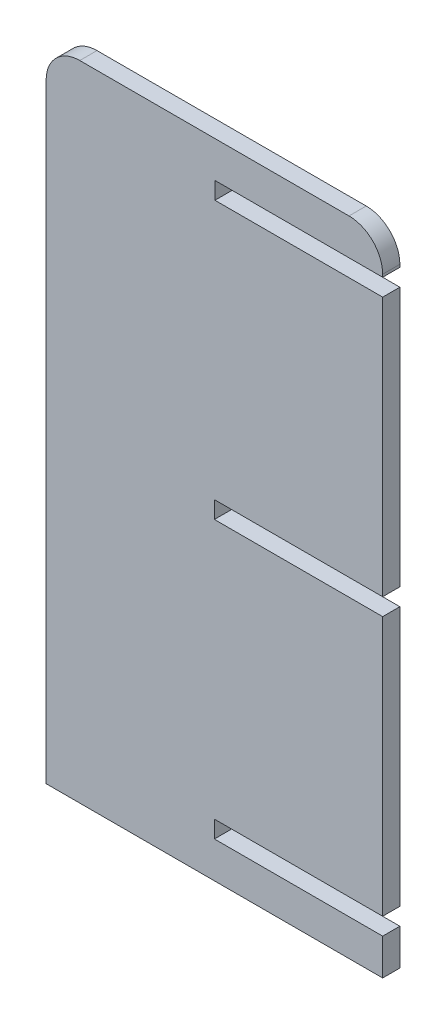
ISO-10303-21;
HEADER;
FILE_DESCRIPTION(('STEP AP214'),'2;1');
FILE_NAME('part.step','',(''),(''),'','','');
FILE_SCHEMA(('AUTOMOTIVE_DESIGN { 1 0 10303 214 1 1 1 1 }'));
ENDSEC;
DATA;
#1=APPLICATION_CONTEXT('core data for automotive mechanical design processes');
#2=APPLICATION_PROTOCOL_DEFINITION('international standard','automotive_design',2000,#1);
#3=PRODUCT_CONTEXT('',#1,'mechanical');
#4=PRODUCT('Part','Part','',(#3));
#5=PRODUCT_RELATED_PRODUCT_CATEGORY('part','',(#4));
#6=PRODUCT_DEFINITION_FORMATION('','',#4);
#7=PRODUCT_DEFINITION_CONTEXT('part definition',#1,'design');
#8=PRODUCT_DEFINITION('design','',#6,#7);
#9=PRODUCT_DEFINITION_SHAPE('','',#8);
#10=(LENGTH_UNIT() NAMED_UNIT(*) SI_UNIT(.MILLI.,.METRE.));
#11=(NAMED_UNIT(*) PLANE_ANGLE_UNIT() SI_UNIT($,.RADIAN.));
#12=(NAMED_UNIT(*) SI_UNIT($,.STERADIAN.) SOLID_ANGLE_UNIT());
#13=UNCERTAINTY_MEASURE_WITH_UNIT(LENGTH_MEASURE(1.E-05),#10,'distance_accuracy_value','');
#14=(GEOMETRIC_REPRESENTATION_CONTEXT(3) GLOBAL_UNCERTAINTY_ASSIGNED_CONTEXT((#13)) GLOBAL_UNIT_ASSIGNED_CONTEXT((#10,
#11,#12)) REPRESENTATION_CONTEXT('',''));
#15=CARTESIAN_POINT('',(0.,0.,0.));
#16=DIRECTION('',(0.,0.,1.));
#17=DIRECTION('',(1.,0.,0.));
#18=AXIS2_PLACEMENT_3D('',#15,#16,#17);
#19=CARTESIAN_POINT('',(-222.670481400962,185.207556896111,23.));
#20=DIRECTION('',(1.,0.,0.));
#21=DIRECTION('',(0.,1.,0.));
#22=AXIS2_PLACEMENT_3D('',#19,#20,#21);
#23=PLANE('',#22);
#24=DIRECTION('',(0.,-1.,0.));
#25=VECTOR('',#24,1.);
#26=CARTESIAN_POINT('',(-222.670481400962,185.207556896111,0.));
#27=LINE('',#26,#25);
#28=CARTESIAN_POINT('',(-222.670481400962,185.207556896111,0.));
#29=VERTEX_POINT('',#28);
#30=CARTESIAN_POINT('',(-222.670481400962,-629.792443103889,0.));
#31=VERTEX_POINT('',#30);
#32=EDGE_CURVE('E188',#29,#31,#27,.T.);
#33=ORIENTED_EDGE('',*,*,#32,.T.);
#34=DIRECTION('',(0.,0.,-1.));
#35=VECTOR('',#34,1.);
#36=CARTESIAN_POINT('',(-222.670481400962,-629.792443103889,23.));
#37=LINE('',#36,#35);
#38=CARTESIAN_POINT('',(-222.670481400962,-629.792443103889,23.));
#39=VERTEX_POINT('',#38);
#40=EDGE_CURVE('E11',#39,#31,#37,.T.);
#41=ORIENTED_EDGE('',*,*,#40,.F.);
#42=DIRECTION('',(0.,-1.,0.));
#43=VECTOR('',#42,1.);
#44=CARTESIAN_POINT('',(-222.670481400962,185.207556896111,23.));
#45=LINE('',#44,#43);
#46=CARTESIAN_POINT('',(-222.670481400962,185.207556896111,23.));
#47=VERTEX_POINT('',#46);
#48=EDGE_CURVE('E222',#47,#39,#45,.T.);
#49=ORIENTED_EDGE('',*,*,#48,.F.);
#50=DIRECTION('',(0.,0.,-1.));
#51=VECTOR('',#50,1.);
#52=CARTESIAN_POINT('',(-222.670481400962,185.207556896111,23.));
#53=LINE('',#52,#51);
#54=EDGE_CURVE('E184',#47,#29,#53,.T.);
#55=ORIENTED_EDGE('',*,*,#54,.T.);
#56=EDGE_LOOP('',(#33,#41,#49,#55));
#57=FACE_BOUND('',#56,.T.);
#58=ADVANCED_FACE('F32',(#57),#23,.F.);
#59=CARTESIAN_POINT('',(-222.670481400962,-629.792443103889,23.));
#60=DIRECTION('',(0.,1.,0.));
#61=DIRECTION('',(0.,0.,1.));
#62=AXIS2_PLACEMENT_3D('',#59,#60,#61);
#63=PLANE('',#62);
#64=DIRECTION('',(1.,0.,0.));
#65=VECTOR('',#64,1.);
#66=CARTESIAN_POINT('',(-222.670481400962,-629.792443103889,0.));
#67=LINE('',#66,#65);
#68=CARTESIAN_POINT('',(227.329518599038,-629.792443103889,0.));
#69=VERTEX_POINT('',#68);
#70=EDGE_CURVE('E191',#31,#69,#67,.T.);
#71=ORIENTED_EDGE('',*,*,#70,.T.);
#72=DIRECTION('',(0.,0.,-1.));
#73=VECTOR('',#72,1.);
#74=CARTESIAN_POINT('',(227.329518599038,-629.792443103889,23.));
#75=LINE('',#74,#73);
#76=CARTESIAN_POINT('',(227.329518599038,-629.792443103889,23.));
#77=VERTEX_POINT('',#76);
#78=EDGE_CURVE('E40',#77,#69,#75,.T.);
#79=ORIENTED_EDGE('',*,*,#78,.F.);
#80=DIRECTION('',(1.,0.,0.));
#81=VECTOR('',#80,1.);
#82=CARTESIAN_POINT('',(-222.670481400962,-629.792443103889,23.));
#83=LINE('',#82,#81);
#84=EDGE_CURVE('E121',#39,#77,#83,.T.);
#85=ORIENTED_EDGE('',*,*,#84,.F.);
#86=ORIENTED_EDGE('',*,*,#40,.T.);
#87=EDGE_LOOP('',(#71,#79,#85,#86));
#88=FACE_BOUND('',#87,.T.);
#89=ADVANCED_FACE('F330',(#88),#63,.F.);
#90=CARTESIAN_POINT('',(227.329518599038,-629.792443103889,23.));
#91=DIRECTION('',(-1.,0.,0.));
#92=DIRECTION('',(0.,0.,1.));
#93=AXIS2_PLACEMENT_3D('',#90,#91,#92);
#94=PLANE('',#93);
#95=DIRECTION('',(0.,1.,0.));
#96=VECTOR('',#95,1.);
#97=CARTESIAN_POINT('',(227.329518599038,-629.792443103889,0.));
#98=LINE('',#97,#96);
#99=CARTESIAN_POINT('',(227.329518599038,-581.292443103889,0.));
#100=VERTEX_POINT('',#99);
#101=EDGE_CURVE('E193',#69,#100,#98,.T.);
#102=ORIENTED_EDGE('',*,*,#101,.T.);
#103=DIRECTION('',(0.,0.,-1.));
#104=VECTOR('',#103,1.);
#105=CARTESIAN_POINT('',(227.329518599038,-581.292443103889,23.));
#106=LINE('',#105,#104);
#107=CARTESIAN_POINT('',(227.329518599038,-581.292443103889,23.));
#108=VERTEX_POINT('',#107);
#109=EDGE_CURVE('E259',#108,#100,#106,.T.);
#110=ORIENTED_EDGE('',*,*,#109,.F.);
#111=DIRECTION('',(0.,1.,0.));
#112=VECTOR('',#111,1.);
#113=CARTESIAN_POINT('',(227.329518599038,-629.792443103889,23.));
#114=LINE('',#113,#112);
#115=EDGE_CURVE('E267',#77,#108,#114,.T.);
#116=ORIENTED_EDGE('',*,*,#115,.F.);
#117=ORIENTED_EDGE('',*,*,#78,.T.);
#118=EDGE_LOOP('',(#102,#110,#116,#117));
#119=FACE_BOUND('',#118,.T.);
#120=ADVANCED_FACE('F265',(#119),#94,.F.);
#121=CARTESIAN_POINT('',(227.329518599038,-581.292443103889,23.));
#122=DIRECTION('',(0.,-1.,0.));
#123=DIRECTION('',(0.,0.,-1.));
#124=AXIS2_PLACEMENT_3D('',#121,#122,#123);
#125=PLANE('',#124);
#126=DIRECTION('',(-1.,0.,0.));
#127=VECTOR('',#126,1.);
#128=CARTESIAN_POINT('',(227.329518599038,-581.292443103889,0.));
#129=LINE('',#128,#127);
#130=CARTESIAN_POINT('',(2.32951859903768,-581.292443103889,0.));
#131=VERTEX_POINT('',#130);
#132=EDGE_CURVE('E195',#100,#131,#129,.T.);
#133=ORIENTED_EDGE('',*,*,#132,.T.);
#134=DIRECTION('',(0.,0.,-1.));
#135=VECTOR('',#134,1.);
#136=CARTESIAN_POINT('',(2.32951859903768,-581.292443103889,23.));
#137=LINE('',#136,#135);
#138=CARTESIAN_POINT('',(2.32951859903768,-581.292443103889,23.));
#139=VERTEX_POINT('',#138);
#140=EDGE_CURVE('E256',#139,#131,#137,.T.);
#141=ORIENTED_EDGE('',*,*,#140,.F.);
#142=DIRECTION('',(-1.,0.,0.));
#143=VECTOR('',#142,1.);
#144=CARTESIAN_POINT('',(227.329518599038,-581.292443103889,23.));
#145=LINE('',#144,#143);
#146=EDGE_CURVE('E285',#108,#139,#145,.T.);
#147=ORIENTED_EDGE('',*,*,#146,.F.);
#148=ORIENTED_EDGE('',*,*,#109,.T.);
#149=EDGE_LOOP('',(#133,#141,#147,#148));
#150=FACE_BOUND('',#149,.T.);
#151=ADVANCED_FACE('F276',(#150),#125,.F.);
#152=CARTESIAN_POINT('',(2.32951859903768,-581.292443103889,23.));
#153=DIRECTION('',(-1.,0.,0.));
#154=DIRECTION('',(0.,0.,1.));
#155=AXIS2_PLACEMENT_3D('',#152,#153,#154);
#156=PLANE('',#155);
#157=DIRECTION('',(0.,1.,0.));
#158=VECTOR('',#157,1.);
#159=CARTESIAN_POINT('',(2.32951859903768,-581.292443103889,0.));
#160=LINE('',#159,#158);
#161=CARTESIAN_POINT('',(2.32951859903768,-558.292443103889,0.));
#162=VERTEX_POINT('',#161);
#163=EDGE_CURVE('E197',#131,#162,#160,.T.);
#164=ORIENTED_EDGE('',*,*,#163,.T.);
#165=DIRECTION('',(0.,0.,-1.));
#166=VECTOR('',#165,1.);
#167=CARTESIAN_POINT('',(2.32951859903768,-558.292443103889,23.));
#168=LINE('',#167,#166);
#169=CARTESIAN_POINT('',(2.32951859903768,-558.292443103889,23.));
#170=VERTEX_POINT('',#169);
#171=EDGE_CURVE('E253',#170,#162,#168,.T.);
#172=ORIENTED_EDGE('',*,*,#171,.F.);
#173=DIRECTION('',(0.,1.,0.));
#174=VECTOR('',#173,1.);
#175=CARTESIAN_POINT('',(2.32951859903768,-581.292443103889,23.));
#176=LINE('',#175,#174);
#177=EDGE_CURVE('E282',#139,#170,#176,.T.);
#178=ORIENTED_EDGE('',*,*,#177,.F.);
#179=ORIENTED_EDGE('',*,*,#140,.T.);
#180=EDGE_LOOP('',(#164,#172,#178,#179));
#181=FACE_BOUND('',#180,.T.);
#182=ADVANCED_FACE('F280',(#181),#156,.F.);
#183=CARTESIAN_POINT('',(2.32951859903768,-558.292443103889,23.));
#184=DIRECTION('',(0.,1.,0.));
#185=DIRECTION('',(0.,0.,1.));
#186=AXIS2_PLACEMENT_3D('',#183,#184,#185);
#187=PLANE('',#186);
#188=DIRECTION('',(1.,0.,0.));
#189=VECTOR('',#188,1.);
#190=CARTESIAN_POINT('',(2.32951859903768,-558.292443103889,0.));
#191=LINE('',#190,#189);
#192=CARTESIAN_POINT('',(227.329518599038,-558.292443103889,0.));
#193=VERTEX_POINT('',#192);
#194=EDGE_CURVE('E199',#162,#193,#191,.T.);
#195=ORIENTED_EDGE('',*,*,#194,.T.);
#196=DIRECTION('',(0.,0.,-1.));
#197=VECTOR('',#196,1.);
#198=CARTESIAN_POINT('',(227.329518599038,-558.292443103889,23.));
#199=LINE('',#198,#197);
#200=CARTESIAN_POINT('',(227.329518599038,-558.292443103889,23.));
#201=VERTEX_POINT('',#200);
#202=EDGE_CURVE('E250',#201,#193,#199,.T.);
#203=ORIENTED_EDGE('',*,*,#202,.F.);
#204=DIRECTION('',(1.,0.,0.));
#205=VECTOR('',#204,1.);
#206=CARTESIAN_POINT('',(2.32951859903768,-558.292443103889,23.));
#207=LINE('',#206,#205);
#208=EDGE_CURVE('E284',#170,#201,#207,.T.);
#209=ORIENTED_EDGE('',*,*,#208,.F.);
#210=ORIENTED_EDGE('',*,*,#171,.T.);
#211=EDGE_LOOP('',(#195,#203,#209,#210));
#212=FACE_BOUND('',#211,.T.);
#213=ADVANCED_FACE('F343',(#212),#187,.F.);
#214=CARTESIAN_POINT('',(227.329518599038,-558.292443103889,23.));
#215=DIRECTION('',(-1.,0.,0.));
#216=DIRECTION('',(0.,0.,1.));
#217=AXIS2_PLACEMENT_3D('',#214,#215,#216);
#218=PLANE('',#217);
#219=DIRECTION('',(0.,1.,0.));
#220=VECTOR('',#219,1.);
#221=CARTESIAN_POINT('',(227.329518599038,-558.292443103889,0.));
#222=LINE('',#221,#220);
#223=CARTESIAN_POINT('',(227.329518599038,-211.292443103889,0.));
#224=VERTEX_POINT('',#223);
#225=EDGE_CURVE('E201',#193,#224,#222,.T.);
#226=ORIENTED_EDGE('',*,*,#225,.T.);
#227=DIRECTION('',(0.,0.,-1.));
#228=VECTOR('',#227,1.);
#229=CARTESIAN_POINT('',(227.329518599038,-211.292443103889,23.));
#230=LINE('',#229,#228);
#231=CARTESIAN_POINT('',(227.329518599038,-211.292443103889,23.));
#232=VERTEX_POINT('',#231);
#233=EDGE_CURVE('E247',#232,#224,#230,.T.);
#234=ORIENTED_EDGE('',*,*,#233,.F.);
#235=DIRECTION('',(0.,1.,0.));
#236=VECTOR('',#235,1.);
#237=CARTESIAN_POINT('',(227.329518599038,-558.292443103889,23.));
#238=LINE('',#237,#236);
#239=EDGE_CURVE('E287',#201,#232,#238,.T.);
#240=ORIENTED_EDGE('',*,*,#239,.F.);
#241=ORIENTED_EDGE('',*,*,#202,.T.);
#242=EDGE_LOOP('',(#226,#234,#240,#241));
#243=FACE_BOUND('',#242,.T.);
#244=ADVANCED_FACE('F346',(#243),#218,.F.);
#245=CARTESIAN_POINT('',(227.329518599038,-211.292443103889,23.));
#246=DIRECTION('',(0.,-1.,0.));
#247=DIRECTION('',(0.,0.,-1.));
#248=AXIS2_PLACEMENT_3D('',#245,#246,#247);
#249=PLANE('',#248);
#250=DIRECTION('',(-1.,0.,0.));
#251=VECTOR('',#250,1.);
#252=CARTESIAN_POINT('',(227.329518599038,-211.292443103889,0.));
#253=LINE('',#252,#251);
#254=CARTESIAN_POINT('',(2.32951859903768,-211.292443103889,0.));
#255=VERTEX_POINT('',#254);
#256=EDGE_CURVE('E203',#224,#255,#253,.T.);
#257=ORIENTED_EDGE('',*,*,#256,.T.);
#258=DIRECTION('',(0.,0.,-1.));
#259=VECTOR('',#258,1.);
#260=CARTESIAN_POINT('',(2.32951859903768,-211.292443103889,23.));
#261=LINE('',#260,#259);
#262=CARTESIAN_POINT('',(2.32951859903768,-211.292443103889,23.));
#263=VERTEX_POINT('',#262);
#264=EDGE_CURVE('E244',#263,#255,#261,.T.);
#265=ORIENTED_EDGE('',*,*,#264,.F.);
#266=DIRECTION('',(-1.,0.,0.));
#267=VECTOR('',#266,1.);
#268=CARTESIAN_POINT('',(227.329518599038,-211.292443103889,23.));
#269=LINE('',#268,#267);
#270=EDGE_CURVE('E293',#232,#263,#269,.T.);
#271=ORIENTED_EDGE('',*,*,#270,.F.);
#272=ORIENTED_EDGE('',*,*,#233,.T.);
#273=EDGE_LOOP('',(#257,#265,#271,#272));
#274=FACE_BOUND('',#273,.T.);
#275=ADVANCED_FACE('F350',(#274),#249,.F.);
#276=CARTESIAN_POINT('',(2.32951859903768,-211.292443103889,23.));
#277=DIRECTION('',(-1.,0.,0.));
#278=DIRECTION('',(0.,0.,1.));
#279=AXIS2_PLACEMENT_3D('',#276,#277,#278);
#280=PLANE('',#279);
#281=DIRECTION('',(0.,1.,0.));
#282=VECTOR('',#281,1.);
#283=CARTESIAN_POINT('',(2.32951859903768,-211.292443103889,0.));
#284=LINE('',#283,#282);
#285=CARTESIAN_POINT('',(2.32951859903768,-188.292443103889,0.));
#286=VERTEX_POINT('',#285);
#287=EDGE_CURVE('E205',#255,#286,#284,.T.);
#288=ORIENTED_EDGE('',*,*,#287,.T.);
#289=DIRECTION('',(0.,0.,-1.));
#290=VECTOR('',#289,1.);
#291=CARTESIAN_POINT('',(2.32951859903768,-188.292443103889,23.));
#292=LINE('',#291,#290);
#293=CARTESIAN_POINT('',(2.32951859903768,-188.292443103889,23.));
#294=VERTEX_POINT('',#293);
#295=EDGE_CURVE('E241',#294,#286,#292,.T.);
#296=ORIENTED_EDGE('',*,*,#295,.F.);
#297=DIRECTION('',(0.,1.,0.));
#298=VECTOR('',#297,1.);
#299=CARTESIAN_POINT('',(2.32951859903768,-211.292443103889,23.));
#300=LINE('',#299,#298);
#301=EDGE_CURVE('E295',#263,#294,#300,.T.);
#302=ORIENTED_EDGE('',*,*,#301,.F.);
#303=ORIENTED_EDGE('',*,*,#264,.T.);
#304=EDGE_LOOP('',(#288,#296,#302,#303));
#305=FACE_BOUND('',#304,.T.);
#306=ADVANCED_FACE('F354',(#305),#280,.F.);
#307=CARTESIAN_POINT('',(2.32951859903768,-188.292443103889,23.));
#308=DIRECTION('',(0.,1.,0.));
#309=DIRECTION('',(0.,0.,1.));
#310=AXIS2_PLACEMENT_3D('',#307,#308,#309);
#311=PLANE('',#310);
#312=DIRECTION('',(1.,0.,0.));
#313=VECTOR('',#312,1.);
#314=CARTESIAN_POINT('',(2.32951859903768,-188.292443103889,0.));
#315=LINE('',#314,#313);
#316=CARTESIAN_POINT('',(227.329518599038,-188.292443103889,0.));
#317=VERTEX_POINT('',#316);
#318=EDGE_CURVE('E207',#286,#317,#315,.T.);
#319=ORIENTED_EDGE('',*,*,#318,.T.);
#320=DIRECTION('',(0.,0.,-1.));
#321=VECTOR('',#320,1.);
#322=CARTESIAN_POINT('',(227.329518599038,-188.292443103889,23.));
#323=LINE('',#322,#321);
#324=CARTESIAN_POINT('',(227.329518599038,-188.292443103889,23.));
#325=VERTEX_POINT('',#324);
#326=EDGE_CURVE('E238',#325,#317,#323,.T.);
#327=ORIENTED_EDGE('',*,*,#326,.F.);
#328=DIRECTION('',(1.,0.,0.));
#329=VECTOR('',#328,1.);
#330=CARTESIAN_POINT('',(2.32951859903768,-188.292443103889,23.));
#331=LINE('',#330,#329);
#332=EDGE_CURVE('E297',#294,#325,#331,.T.);
#333=ORIENTED_EDGE('',*,*,#332,.F.);
#334=ORIENTED_EDGE('',*,*,#295,.T.);
#335=EDGE_LOOP('',(#319,#327,#333,#334));
#336=FACE_BOUND('',#335,.T.);
#337=ADVANCED_FACE('F358',(#336),#311,.F.);
#338=CARTESIAN_POINT('',(227.329518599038,-188.292443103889,23.));
#339=DIRECTION('',(-1.,0.,0.));
#340=DIRECTION('',(0.,0.,1.));
#341=AXIS2_PLACEMENT_3D('',#338,#339,#340);
#342=PLANE('',#341);
#343=DIRECTION('',(0.,1.,0.));
#344=VECTOR('',#343,1.);
#345=CARTESIAN_POINT('',(227.329518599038,-188.292443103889,0.));
#346=LINE('',#345,#344);
#347=CARTESIAN_POINT('',(227.329518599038,158.707556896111,0.));
#348=VERTEX_POINT('',#347);
#349=EDGE_CURVE('E209',#317,#348,#346,.T.);
#350=ORIENTED_EDGE('',*,*,#349,.T.);
#351=DIRECTION('',(0.,0.,-1.));
#352=VECTOR('',#351,1.);
#353=CARTESIAN_POINT('',(227.329518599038,158.707556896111,23.));
#354=LINE('',#353,#352);
#355=CARTESIAN_POINT('',(227.329518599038,158.707556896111,23.));
#356=VERTEX_POINT('',#355);
#357=EDGE_CURVE('E235',#356,#348,#354,.T.);
#358=ORIENTED_EDGE('',*,*,#357,.F.);
#359=DIRECTION('',(0.,1.,0.));
#360=VECTOR('',#359,1.);
#361=CARTESIAN_POINT('',(227.329518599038,-188.292443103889,23.));
#362=LINE('',#361,#360);
#363=EDGE_CURVE('E299',#325,#356,#362,.T.);
#364=ORIENTED_EDGE('',*,*,#363,.F.);
#365=ORIENTED_EDGE('',*,*,#326,.T.);
#366=EDGE_LOOP('',(#350,#358,#364,#365));
#367=FACE_BOUND('',#366,.T.);
#368=ADVANCED_FACE('F362',(#367),#342,.F.);
#369=CARTESIAN_POINT('',(227.329518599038,158.707556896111,23.));
#370=DIRECTION('',(0.,-1.,0.));
#371=DIRECTION('',(0.,0.,-1.));
#372=AXIS2_PLACEMENT_3D('',#369,#370,#371);
#373=PLANE('',#372);
#374=DIRECTION('',(-1.,0.,0.));
#375=VECTOR('',#374,1.);
#376=CARTESIAN_POINT('',(227.329518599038,158.707556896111,0.));
#377=LINE('',#376,#375);
#378=CARTESIAN_POINT('',(3.03200274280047,158.707556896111,0.));
#379=VERTEX_POINT('',#378);
#380=EDGE_CURVE('E211',#348,#379,#377,.T.);
#381=ORIENTED_EDGE('',*,*,#380,.T.);
#382=DIRECTION('',(0.,0.,-1.));
#383=VECTOR('',#382,1.);
#384=CARTESIAN_POINT('',(3.03200274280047,158.707556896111,23.));
#385=LINE('',#384,#383);
#386=CARTESIAN_POINT('',(3.03200274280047,158.707556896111,23.));
#387=VERTEX_POINT('',#386);
#388=EDGE_CURVE('E232',#387,#379,#385,.T.);
#389=ORIENTED_EDGE('',*,*,#388,.F.);
#390=DIRECTION('',(-1.,0.,0.));
#391=VECTOR('',#390,1.);
#392=CARTESIAN_POINT('',(227.329518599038,158.707556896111,23.));
#393=LINE('',#392,#391);
#394=EDGE_CURVE('E301',#356,#387,#393,.T.);
#395=ORIENTED_EDGE('',*,*,#394,.F.);
#396=ORIENTED_EDGE('',*,*,#357,.T.);
#397=EDGE_LOOP('',(#381,#389,#395,#396));
#398=FACE_BOUND('',#397,.T.);
#399=ADVANCED_FACE('F366',(#398),#373,.F.);
#400=CARTESIAN_POINT('',(3.03200274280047,158.707556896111,23.));
#401=DIRECTION('',(-1.,0.,0.));
#402=DIRECTION('',(0.,0.,1.));
#403=AXIS2_PLACEMENT_3D('',#400,#401,#402);
#404=PLANE('',#403);
#405=DIRECTION('',(0.,1.,0.));
#406=VECTOR('',#405,1.);
#407=CARTESIAN_POINT('',(3.03200274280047,158.707556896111,0.));
#408=LINE('',#407,#406);
#409=CARTESIAN_POINT('',(3.03200274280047,181.707556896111,0.));
#410=VERTEX_POINT('',#409);
#411=EDGE_CURVE('E213',#379,#410,#408,.T.);
#412=ORIENTED_EDGE('',*,*,#411,.T.);
#413=DIRECTION('',(0.,0.,-1.));
#414=VECTOR('',#413,1.);
#415=CARTESIAN_POINT('',(3.03200274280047,181.707556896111,23.));
#416=LINE('',#415,#414);
#417=CARTESIAN_POINT('',(3.03200274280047,181.707556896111,23.));
#418=VERTEX_POINT('',#417);
#419=EDGE_CURVE('E229',#418,#410,#416,.T.);
#420=ORIENTED_EDGE('',*,*,#419,.F.);
#421=DIRECTION('',(0.,1.,0.));
#422=VECTOR('',#421,1.);
#423=CARTESIAN_POINT('',(3.03200274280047,158.707556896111,23.));
#424=LINE('',#423,#422);
#425=EDGE_CURVE('E303',#387,#418,#424,.T.);
#426=ORIENTED_EDGE('',*,*,#425,.F.);
#427=ORIENTED_EDGE('',*,*,#388,.T.);
#428=EDGE_LOOP('',(#412,#420,#426,#427));
#429=FACE_BOUND('',#428,.T.);
#430=ADVANCED_FACE('F370',(#429),#404,.F.);
#431=CARTESIAN_POINT('',(3.03200274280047,181.707556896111,23.));
#432=DIRECTION('',(0.,1.,0.));
#433=DIRECTION('',(0.,0.,1.));
#434=AXIS2_PLACEMENT_3D('',#431,#432,#433);
#435=PLANE('',#434);
#436=DIRECTION('',(1.,0.,0.));
#437=VECTOR('',#436,1.);
#438=CARTESIAN_POINT('',(3.03200274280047,181.707556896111,0.));
#439=LINE('',#438,#437);
#440=CARTESIAN_POINT('',(227.329518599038,181.707556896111,0.));
#441=VERTEX_POINT('',#440);
#442=EDGE_CURVE('E215',#410,#441,#439,.T.);
#443=ORIENTED_EDGE('',*,*,#442,.T.);
#444=DIRECTION('',(0.,0.,-1.));
#445=VECTOR('',#444,1.);
#446=CARTESIAN_POINT('',(227.329518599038,181.707556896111,23.));
#447=LINE('',#446,#445);
#448=CARTESIAN_POINT('',(227.329518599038,181.707556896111,23.));
#449=VERTEX_POINT('',#448);
#450=EDGE_CURVE('E226',#449,#441,#447,.T.);
#451=ORIENTED_EDGE('',*,*,#450,.F.);
#452=DIRECTION('',(1.,0.,0.));
#453=VECTOR('',#452,1.);
#454=CARTESIAN_POINT('',(3.03200274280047,181.707556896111,23.));
#455=LINE('',#454,#453);
#456=EDGE_CURVE('E305',#418,#449,#455,.T.);
#457=ORIENTED_EDGE('',*,*,#456,.F.);
#458=ORIENTED_EDGE('',*,*,#419,.T.);
#459=EDGE_LOOP('',(#443,#451,#457,#458));
#460=FACE_BOUND('',#459,.T.);
#461=ADVANCED_FACE('F311',(#460),#435,.F.);
#462=CARTESIAN_POINT('',(227.329518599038,181.707556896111,23.));
#463=DIRECTION('',(-1.,0.,0.));
#464=DIRECTION('',(0.,0.,1.));
#465=AXIS2_PLACEMENT_3D('',#462,#463,#464);
#466=PLANE('',#465);
#467=DIRECTION('',(0.,1.,0.));
#468=VECTOR('',#467,1.);
#469=CARTESIAN_POINT('',(227.329518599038,181.707556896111,0.));
#470=LINE('',#469,#468);
#471=CARTESIAN_POINT('',(227.329518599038,185.207556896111,0.));
#472=VERTEX_POINT('',#471);
#473=EDGE_CURVE('E217',#441,#472,#470,.T.);
#474=ORIENTED_EDGE('',*,*,#473,.T.);
#475=DIRECTION('',(0.,0.,-1.));
#476=VECTOR('',#475,1.);
#477=CARTESIAN_POINT('',(227.329518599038,185.207556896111,23.));
#478=LINE('',#477,#476);
#479=CARTESIAN_POINT('',(227.329518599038,185.207556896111,23.));
#480=VERTEX_POINT('',#479);
#481=EDGE_CURVE('E179',#480,#472,#478,.T.);
#482=ORIENTED_EDGE('',*,*,#481,.F.);
#483=DIRECTION('',(0.,1.,0.));
#484=VECTOR('',#483,1.);
#485=CARTESIAN_POINT('',(227.329518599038,181.707556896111,23.));
#486=LINE('',#485,#484);
#487=EDGE_CURVE('E170',#449,#480,#486,.T.);
#488=ORIENTED_EDGE('',*,*,#487,.F.);
#489=ORIENTED_EDGE('',*,*,#450,.T.);
#490=EDGE_LOOP('',(#474,#482,#488,#489));
#491=FACE_BOUND('',#490,.T.);
#492=ADVANCED_FACE('F315',(#491),#466,.F.);
#493=CARTESIAN_POINT('',(182.329518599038,185.207556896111,23.));
#494=DIRECTION('',(0.,0.,-1.));
#495=DIRECTION('',(-1.,0.,0.));
#496=AXIS2_PLACEMENT_3D('',#493,#494,#495);
#497=CYLINDRICAL_SURFACE('',#496,45.);
#498=CARTESIAN_POINT('',(182.329518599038,185.207556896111,0.));
#499=DIRECTION('',(0.,0.,1.));
#500=DIRECTION('',(1.,0.,0.));
#501=AXIS2_PLACEMENT_3D('',#498,#499,#500);
#502=CIRCLE('',#501,45.);
#503=CARTESIAN_POINT('',(182.329518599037,230.207556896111,0.));
#504=VERTEX_POINT('',#503);
#505=EDGE_CURVE('E178',#472,#504,#502,.T.);
#506=ORIENTED_EDGE('',*,*,#505,.T.);
#507=DIRECTION('',(0.,0.,-1.));
#508=VECTOR('',#507,1.);
#509=CARTESIAN_POINT('',(182.329518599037,230.207556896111,23.));
#510=LINE('',#509,#508);
#511=CARTESIAN_POINT('',(182.329518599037,230.207556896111,23.));
#512=VERTEX_POINT('',#511);
#513=EDGE_CURVE('E175',#512,#504,#510,.T.);
#514=ORIENTED_EDGE('',*,*,#513,.F.);
#515=CARTESIAN_POINT('',(182.329518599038,185.207556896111,23.));
#516=DIRECTION('',(0.,0.,1.));
#517=DIRECTION('',(1.,0.,0.));
#518=AXIS2_PLACEMENT_3D('',#515,#516,#517);
#519=CIRCLE('',#518,45.);
#520=EDGE_CURVE('E164',#480,#512,#519,.T.);
#521=ORIENTED_EDGE('',*,*,#520,.F.);
#522=ORIENTED_EDGE('',*,*,#481,.T.);
#523=EDGE_LOOP('',(#506,#514,#521,#522));
#524=FACE_BOUND('',#523,.T.);
#525=ADVANCED_FACE('F176',(#524),#497,.T.);
#526=CARTESIAN_POINT('',(182.329518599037,230.207556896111,23.));
#527=DIRECTION('',(0.,-1.,0.));
#528=DIRECTION('',(1.,0.,0.));
#529=AXIS2_PLACEMENT_3D('',#526,#527,#528);
#530=PLANE('',#529);
#531=DIRECTION('',(-1.,0.,0.));
#532=VECTOR('',#531,1.);
#533=CARTESIAN_POINT('',(182.329518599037,230.207556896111,0.));
#534=LINE('',#533,#532);
#535=CARTESIAN_POINT('',(-177.670481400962,230.207556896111,0.));
#536=VERTEX_POINT('',#535);
#537=EDGE_CURVE('E107',#504,#536,#534,.T.);
#538=ORIENTED_EDGE('',*,*,#537,.T.);
#539=DIRECTION('',(0.,0.,-1.));
#540=VECTOR('',#539,1.);
#541=CARTESIAN_POINT('',(-177.670481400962,230.207556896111,23.));
#542=LINE('',#541,#540);
#543=CARTESIAN_POINT('',(-177.670481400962,230.207556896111,23.));
#544=VERTEX_POINT('',#543);
#545=EDGE_CURVE('E180',#544,#536,#542,.T.);
#546=ORIENTED_EDGE('',*,*,#545,.F.);
#547=DIRECTION('',(-1.,0.,0.));
#548=VECTOR('',#547,1.);
#549=CARTESIAN_POINT('',(182.329518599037,230.207556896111,23.));
#550=LINE('',#549,#548);
#551=EDGE_CURVE('E168',#512,#544,#550,.T.);
#552=ORIENTED_EDGE('',*,*,#551,.F.);
#553=ORIENTED_EDGE('',*,*,#513,.T.);
#554=EDGE_LOOP('',(#538,#546,#552,#553));
#555=FACE_BOUND('',#554,.T.);
#556=ADVANCED_FACE('F182',(#555),#530,.F.);
#557=CARTESIAN_POINT('',(-177.670481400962,185.207556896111,23.));
#558=DIRECTION('',(0.,0.,-1.));
#559=DIRECTION('',(-1.,0.,0.));
#560=AXIS2_PLACEMENT_3D('',#557,#558,#559);
#561=CYLINDRICAL_SURFACE('',#560,45.);
#562=CARTESIAN_POINT('',(-177.670481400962,185.207556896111,0.));
#563=DIRECTION('',(0.,0.,1.));
#564=DIRECTION('',(1.,0.,0.));
#565=AXIS2_PLACEMENT_3D('',#562,#563,#564);
#566=CIRCLE('',#565,45.);
#567=EDGE_CURVE('E113',#536,#29,#566,.T.);
#568=ORIENTED_EDGE('',*,*,#567,.T.);
#569=ORIENTED_EDGE('',*,*,#54,.F.);
#570=CARTESIAN_POINT('',(-177.670481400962,185.207556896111,23.));
#571=DIRECTION('',(0.,0.,1.));
#572=DIRECTION('',(1.,0.,0.));
#573=AXIS2_PLACEMENT_3D('',#570,#571,#572);
#574=CIRCLE('',#573,45.);
#575=EDGE_CURVE('E48',#544,#47,#574,.T.);
#576=ORIENTED_EDGE('',*,*,#575,.F.);
#577=ORIENTED_EDGE('',*,*,#545,.T.);
#578=EDGE_LOOP('',(#568,#569,#576,#577));
#579=FACE_BOUND('',#578,.T.);
#580=ADVANCED_FACE('F319',(#579),#561,.T.);
#581=CARTESIAN_POINT('',(182.329518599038,185.207556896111,23.));
#582=DIRECTION('',(0.,0.,1.));
#583=DIRECTION('',(1.,0.,0.));
#584=AXIS2_PLACEMENT_3D('',#581,#582,#583);
#585=PLANE('',#584);
#586=ORIENTED_EDGE('',*,*,#48,.T.);
#587=ORIENTED_EDGE('',*,*,#84,.T.);
#588=ORIENTED_EDGE('',*,*,#115,.T.);
#589=ORIENTED_EDGE('',*,*,#146,.T.);
#590=ORIENTED_EDGE('',*,*,#177,.T.);
#591=ORIENTED_EDGE('',*,*,#208,.T.);
#592=ORIENTED_EDGE('',*,*,#239,.T.);
#593=ORIENTED_EDGE('',*,*,#270,.T.);
#594=ORIENTED_EDGE('',*,*,#301,.T.);
#595=ORIENTED_EDGE('',*,*,#332,.T.);
#596=ORIENTED_EDGE('',*,*,#363,.T.);
#597=ORIENTED_EDGE('',*,*,#394,.T.);
#598=ORIENTED_EDGE('',*,*,#425,.T.);
#599=ORIENTED_EDGE('',*,*,#456,.T.);
#600=ORIENTED_EDGE('',*,*,#487,.T.);
#601=ORIENTED_EDGE('',*,*,#520,.T.);
#602=ORIENTED_EDGE('',*,*,#551,.T.);
#603=ORIENTED_EDGE('',*,*,#575,.T.);
#604=EDGE_LOOP('',(#586,#587,#588,#589,#590,#591,#592,#593,#594,#595,#596,#597,#598,#599,#600,
#601,#602,#603));
#605=FACE_BOUND('',#604,.T.);
#606=ADVANCED_FACE('F166',(#605),#585,.T.);
#607=CARTESIAN_POINT('',(182.329518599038,185.207556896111,0.));
#608=DIRECTION('',(0.,0.,1.));
#609=DIRECTION('',(1.,0.,0.));
#610=AXIS2_PLACEMENT_3D('',#607,#608,#609);
#611=PLANE('',#610);
#612=ORIENTED_EDGE('',*,*,#32,.F.);
#613=ORIENTED_EDGE('',*,*,#567,.F.);
#614=ORIENTED_EDGE('',*,*,#537,.F.);
#615=ORIENTED_EDGE('',*,*,#505,.F.);
#616=ORIENTED_EDGE('',*,*,#473,.F.);
#617=ORIENTED_EDGE('',*,*,#442,.F.);
#618=ORIENTED_EDGE('',*,*,#411,.F.);
#619=ORIENTED_EDGE('',*,*,#380,.F.);
#620=ORIENTED_EDGE('',*,*,#349,.F.);
#621=ORIENTED_EDGE('',*,*,#318,.F.);
#622=ORIENTED_EDGE('',*,*,#287,.F.);
#623=ORIENTED_EDGE('',*,*,#256,.F.);
#624=ORIENTED_EDGE('',*,*,#225,.F.);
#625=ORIENTED_EDGE('',*,*,#194,.F.);
#626=ORIENTED_EDGE('',*,*,#163,.F.);
#627=ORIENTED_EDGE('',*,*,#132,.F.);
#628=ORIENTED_EDGE('',*,*,#101,.F.);
#629=ORIENTED_EDGE('',*,*,#70,.F.);
#630=EDGE_LOOP('',(#612,#613,#614,#615,#616,#617,#618,#619,#620,#621,#622,#623,#624,#625,#626,
#627,#628,#629));
#631=FACE_BOUND('',#630,.T.);
#632=ADVANCED_FACE('F271',(#631),#611,.F.);
#633=CLOSED_SHELL('',(#58,#89,#120,#151,#182,#213,#244,#275,#306,#337,#368,#399,#430,#461,#492,
#525,#556,#580,#606,#632));
#634=MANIFOLD_SOLID_BREP('B2',#633);
#635=ADVANCED_BREP_SHAPE_REPRESENTATION('',(#18,#634),#14);
#636=SHAPE_DEFINITION_REPRESENTATION(#9,#635);
ENDSEC;
END-ISO-10303-21;
